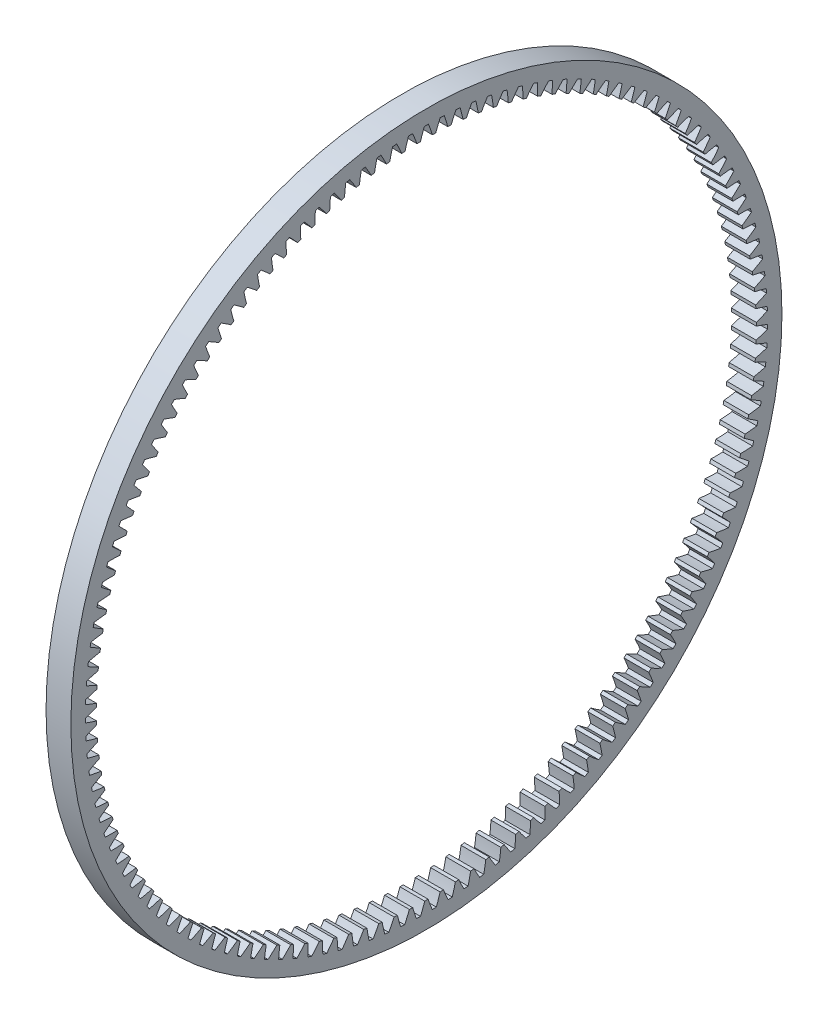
from build123d import *

# Parameters (mm, degrees)
BASPROSKE_W     = 15
BASPROSKE_H     = 15.5
TOOTHCUT_DEPTH  = 305.425688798
TEETHCUTS_COUNT = 135
TEETHCUTS_ANGLE = 357.333333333


with BuildPart() as part:
    # BasProSke → Base-Revolve (revolve)
    with BuildSketch(Plane(origin=(0, 0, 0), x_dir=(1, 0, 0), z_dir=(0, 1, 0)), mode=Mode.PRIVATE) as base_revolve_sk:
        with Locations((7.5, 207.25)):
            Rectangle(BASPROSKE_W, BASPROSKE_H)
    revolve(base_revolve_sk.sketch.rotate(Axis((-10, 0, 0), (1, 0, 0)), 180), axis=Axis((-10, 0, 0), (1, 0, 0)))

    # TooCutSke → ToothCut (cut, through all)
    with BuildSketch(Plane(origin=(0, 0, 0), x_dir=(0, 0, -1), z_dir=(1, 0, 0))):
        with BuildLine():
            ThreePointArc((3.63067197, 199.441556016), (2.489248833, 202.865885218), (1.226493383, 206.247353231))
            ThreePointArc((1.226493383, 206.247353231), (0, 206.251), (-1.226493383, 206.247353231))
            ThreePointArc((-1.226493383, 206.247353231), (-2.489248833, 202.865885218), (-3.63067197, 199.441556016))
            ThreePointArc((-3.63067197, 199.441556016), (0, 199.4746), (3.63067197, 199.441556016))
        make_face()
    toothcut = extrude(amount=TOOTHCUT_DEPTH, mode=Mode.SUBTRACT)

    # TeethCuts: ToothCut ×135 about axis
    teethcuts_axis = Axis((-10, 0, 0), (1, 0, 0))
    for i in range(1, TEETHCUTS_COUNT):
        add(toothcut.rotate(teethcuts_axis, i * TEETHCUTS_ANGLE / (TEETHCUTS_COUNT - 1)), mode=Mode.SUBTRACT)


solid = part.part
